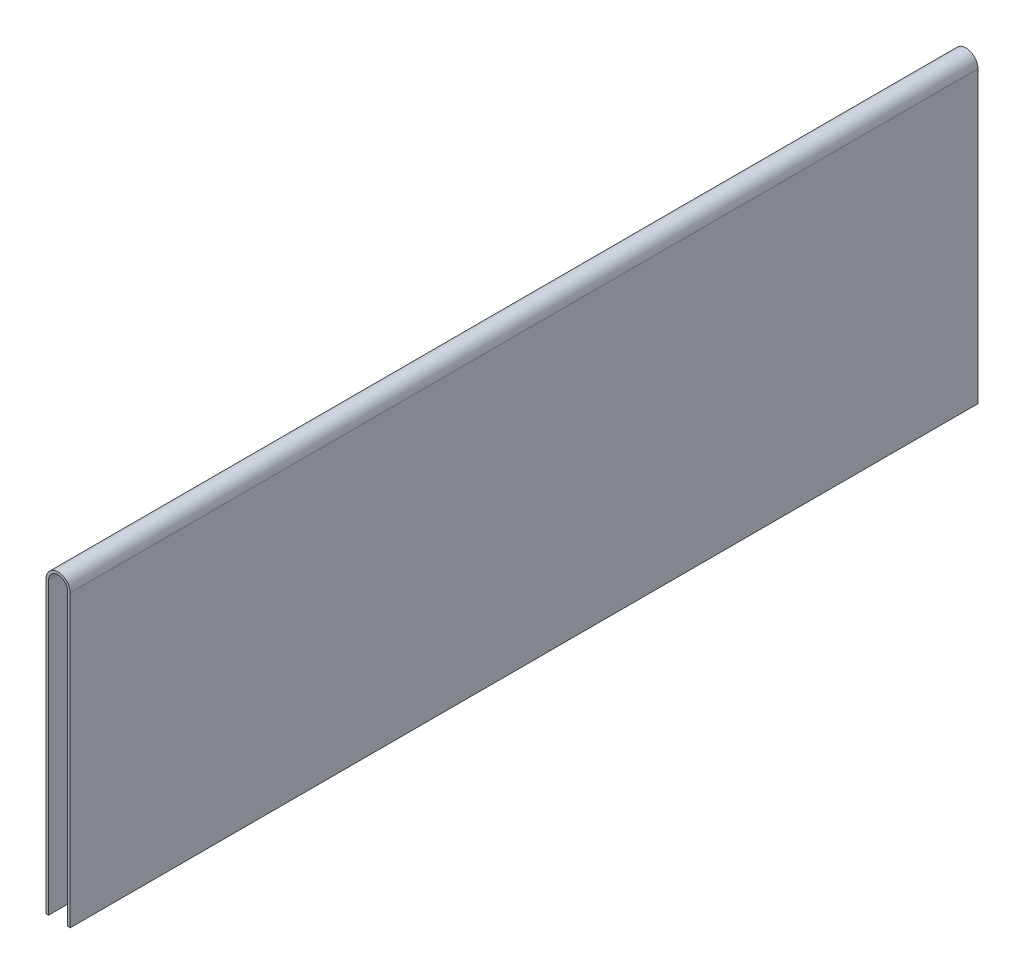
ISO-10303-21;
HEADER;
FILE_DESCRIPTION(('STEP AP214'),'2;1');
FILE_NAME('part.step','',(''),(''),'','','');
FILE_SCHEMA(('AUTOMOTIVE_DESIGN { 1 0 10303 214 1 1 1 1 }'));
ENDSEC;
DATA;
#1=APPLICATION_CONTEXT('core data for automotive mechanical design processes');
#2=APPLICATION_PROTOCOL_DEFINITION('international standard','automotive_design',2000,#1);
#3=PRODUCT_CONTEXT('',#1,'mechanical');
#4=PRODUCT('Part','Part','',(#3));
#5=PRODUCT_RELATED_PRODUCT_CATEGORY('part','',(#4));
#6=PRODUCT_DEFINITION_FORMATION('','',#4);
#7=PRODUCT_DEFINITION_CONTEXT('part definition',#1,'design');
#8=PRODUCT_DEFINITION('design','',#6,#7);
#9=PRODUCT_DEFINITION_SHAPE('','',#8);
#10=(LENGTH_UNIT() NAMED_UNIT(*) SI_UNIT(.MILLI.,.METRE.));
#11=(NAMED_UNIT(*) PLANE_ANGLE_UNIT() SI_UNIT($,.RADIAN.));
#12=(NAMED_UNIT(*) SI_UNIT($,.STERADIAN.) SOLID_ANGLE_UNIT());
#13=UNCERTAINTY_MEASURE_WITH_UNIT(LENGTH_MEASURE(1.E-05),#10,'distance_accuracy_value','');
#14=(GEOMETRIC_REPRESENTATION_CONTEXT(3) GLOBAL_UNCERTAINTY_ASSIGNED_CONTEXT((#13)) GLOBAL_UNIT_ASSIGNED_CONTEXT((#10,
#11,#12)) REPRESENTATION_CONTEXT('',''));
#15=CARTESIAN_POINT('',(0.,0.,0.));
#16=DIRECTION('',(0.,0.,1.));
#17=DIRECTION('',(1.,0.,0.));
#18=AXIS2_PLACEMENT_3D('',#15,#16,#17);
#19=CARTESIAN_POINT('',(-12.192,0.,914.4));
#20=DIRECTION('',(1.,0.,0.));
#21=DIRECTION('',(0.,1.,0.));
#22=AXIS2_PLACEMENT_3D('',#19,#20,#21);
#23=PLANE('',#22);
#24=DIRECTION('',(0.,-1.,0.));
#25=VECTOR('',#24,1.);
#26=CARTESIAN_POINT('',(-12.192,0.,0.));
#27=LINE('',#26,#25);
#28=CARTESIAN_POINT('',(-12.192,0.,0.));
#29=VERTEX_POINT('',#28);
#30=CARTESIAN_POINT('',(-12.192,-292.1,0.));
#31=VERTEX_POINT('',#30);
#32=EDGE_CURVE('E139',#29,#31,#27,.T.);
#33=ORIENTED_EDGE('',*,*,#32,.T.);
#34=DIRECTION('',(0.,0.,-1.));
#35=VECTOR('',#34,1.);
#36=CARTESIAN_POINT('',(-12.192,-292.1,914.4));
#37=LINE('',#36,#35);
#38=CARTESIAN_POINT('',(-12.192,-292.1,914.4));
#39=VERTEX_POINT('',#38);
#40=EDGE_CURVE('E13',#39,#31,#37,.T.);
#41=ORIENTED_EDGE('',*,*,#40,.F.);
#42=DIRECTION('',(0.,-1.,0.));
#43=VECTOR('',#42,1.);
#44=CARTESIAN_POINT('',(-12.192,0.,914.4));
#45=LINE('',#44,#43);
#46=CARTESIAN_POINT('',(-12.192,0.,914.4));
#47=VERTEX_POINT('',#46);
#48=EDGE_CURVE('E97',#47,#39,#45,.T.);
#49=ORIENTED_EDGE('',*,*,#48,.F.);
#50=DIRECTION('',(0.,0.,-1.));
#51=VECTOR('',#50,1.);
#52=CARTESIAN_POINT('',(-12.192,0.,914.4));
#53=LINE('',#52,#51);
#54=EDGE_CURVE('E138',#47,#29,#53,.T.);
#55=ORIENTED_EDGE('',*,*,#54,.T.);
#56=EDGE_LOOP('',(#33,#41,#49,#55));
#57=FACE_BOUND('',#56,.T.);
#58=ADVANCED_FACE('F42',(#57),#23,.F.);
#59=CARTESIAN_POINT('',(-9.65199999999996,-292.1,914.4));
#60=DIRECTION('',(0.,-1.,0.));
#61=DIRECTION('',(0.,0.,-1.));
#62=AXIS2_PLACEMENT_3D('',#59,#60,#61);
#63=PLANE('',#62);
#64=DIRECTION('',(-1.,0.,0.));
#65=VECTOR('',#64,1.);
#66=CARTESIAN_POINT('',(-9.65199999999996,-292.1,0.));
#67=LINE('',#66,#65);
#68=CARTESIAN_POINT('',(-9.65199999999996,-292.1,0.));
#69=VERTEX_POINT('',#68);
#70=EDGE_CURVE('E142',#69,#31,#67,.T.);
#71=ORIENTED_EDGE('',*,*,#70,.F.);
#72=DIRECTION('',(0.,0.,-1.));
#73=VECTOR('',#72,1.);
#74=CARTESIAN_POINT('',(-9.65199999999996,-292.1,914.4));
#75=LINE('',#74,#73);
#76=CARTESIAN_POINT('',(-9.65199999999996,-292.1,914.4));
#77=VERTEX_POINT('',#76);
#78=EDGE_CURVE('E50',#77,#69,#75,.T.);
#79=ORIENTED_EDGE('',*,*,#78,.F.);
#80=DIRECTION('',(-1.,0.,0.));
#81=VECTOR('',#80,1.);
#82=CARTESIAN_POINT('',(-9.65199999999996,-292.1,914.4));
#83=LINE('',#82,#81);
#84=EDGE_CURVE('E181',#77,#39,#83,.T.);
#85=ORIENTED_EDGE('',*,*,#84,.T.);
#86=ORIENTED_EDGE('',*,*,#40,.T.);
#87=EDGE_LOOP('',(#71,#79,#85,#86));
#88=FACE_BOUND('',#87,.T.);
#89=ADVANCED_FACE('F172',(#88),#63,.T.);
#90=CARTESIAN_POINT('',(-9.652,0.,914.4));
#91=DIRECTION('',(1.,0.,0.));
#92=DIRECTION('',(0.,1.,0.));
#93=AXIS2_PLACEMENT_3D('',#90,#91,#92);
#94=PLANE('',#93);
#95=DIRECTION('',(0.,-1.,0.));
#96=VECTOR('',#95,1.);
#97=CARTESIAN_POINT('',(-9.652,0.,0.));
#98=LINE('',#97,#96);
#99=CARTESIAN_POINT('',(-9.652,0.,0.));
#100=VERTEX_POINT('',#99);
#101=EDGE_CURVE('E145',#100,#69,#98,.T.);
#102=ORIENTED_EDGE('',*,*,#101,.F.);
#103=DIRECTION('',(0.,0.,-1.));
#104=VECTOR('',#103,1.);
#105=CARTESIAN_POINT('',(-9.652,0.,914.4));
#106=LINE('',#105,#104);
#107=CARTESIAN_POINT('',(-9.652,0.,914.4));
#108=VERTEX_POINT('',#107);
#109=EDGE_CURVE('E162',#108,#100,#106,.T.);
#110=ORIENTED_EDGE('',*,*,#109,.F.);
#111=DIRECTION('',(0.,-1.,0.));
#112=VECTOR('',#111,1.);
#113=CARTESIAN_POINT('',(-9.652,0.,914.4));
#114=LINE('',#113,#112);
#115=EDGE_CURVE('E169',#108,#77,#114,.T.);
#116=ORIENTED_EDGE('',*,*,#115,.T.);
#117=ORIENTED_EDGE('',*,*,#78,.T.);
#118=EDGE_LOOP('',(#102,#110,#116,#117));
#119=FACE_BOUND('',#118,.T.);
#120=ADVANCED_FACE('F167',(#119),#94,.T.);
#121=CARTESIAN_POINT('',(0.,0.,914.4));
#122=DIRECTION('',(0.,0.,-1.));
#123=DIRECTION('',(-1.,0.,0.));
#124=AXIS2_PLACEMENT_3D('',#121,#122,#123);
#125=CYLINDRICAL_SURFACE('',#124,9.652);
#126=CARTESIAN_POINT('',(0.,0.,0.));
#127=DIRECTION('',(0.,0.,1.));
#128=DIRECTION('',(1.,0.,0.));
#129=AXIS2_PLACEMENT_3D('',#126,#127,#128);
#130=CIRCLE('',#129,9.652);
#131=CARTESIAN_POINT('',(9.652,0.,0.));
#132=VERTEX_POINT('',#131);
#133=EDGE_CURVE('E148',#132,#100,#130,.T.);
#134=ORIENTED_EDGE('',*,*,#133,.F.);
#135=DIRECTION('',(0.,0.,-1.));
#136=VECTOR('',#135,1.);
#137=CARTESIAN_POINT('',(9.652,0.,914.4));
#138=LINE('',#137,#136);
#139=CARTESIAN_POINT('',(9.652,0.,914.4));
#140=VERTEX_POINT('',#139);
#141=EDGE_CURVE('E160',#140,#132,#138,.T.);
#142=ORIENTED_EDGE('',*,*,#141,.F.);
#143=CARTESIAN_POINT('',(0.,0.,914.4));
#144=DIRECTION('',(0.,0.,1.));
#145=DIRECTION('',(1.,0.,0.));
#146=AXIS2_PLACEMENT_3D('',#143,#144,#145);
#147=CIRCLE('',#146,9.652);
#148=EDGE_CURVE('E133',#140,#108,#147,.T.);
#149=ORIENTED_EDGE('',*,*,#148,.T.);
#150=ORIENTED_EDGE('',*,*,#109,.T.);
#151=EDGE_LOOP('',(#134,#142,#149,#150));
#152=FACE_BOUND('',#151,.T.);
#153=ADVANCED_FACE('F179',(#152),#125,.F.);
#154=CARTESIAN_POINT('',(9.652,0.,914.4));
#155=DIRECTION('',(-1.,0.,0.));
#156=DIRECTION('',(0.,-1.,0.));
#157=AXIS2_PLACEMENT_3D('',#154,#155,#156);
#158=PLANE('',#157);
#159=DIRECTION('',(0.,1.,0.));
#160=VECTOR('',#159,1.);
#161=CARTESIAN_POINT('',(9.652,0.,0.));
#162=LINE('',#161,#160);
#163=CARTESIAN_POINT('',(9.65200000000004,-292.1,0.));
#164=VERTEX_POINT('',#163);
#165=EDGE_CURVE('E151',#164,#132,#162,.T.);
#166=ORIENTED_EDGE('',*,*,#165,.F.);
#167=DIRECTION('',(0.,0.,-1.));
#168=VECTOR('',#167,1.);
#169=CARTESIAN_POINT('',(9.65200000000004,-292.1,914.4));
#170=LINE('',#169,#168);
#171=CARTESIAN_POINT('',(9.65200000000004,-292.1,914.4));
#172=VERTEX_POINT('',#171);
#173=EDGE_CURVE('E121',#172,#164,#170,.T.);
#174=ORIENTED_EDGE('',*,*,#173,.F.);
#175=DIRECTION('',(0.,1.,0.));
#176=VECTOR('',#175,1.);
#177=CARTESIAN_POINT('',(9.652,0.,914.4));
#178=LINE('',#177,#176);
#179=EDGE_CURVE('E131',#172,#140,#178,.T.);
#180=ORIENTED_EDGE('',*,*,#179,.T.);
#181=ORIENTED_EDGE('',*,*,#141,.T.);
#182=EDGE_LOOP('',(#166,#174,#180,#181));
#183=FACE_BOUND('',#182,.T.);
#184=ADVANCED_FACE('F186',(#183),#158,.T.);
#185=CARTESIAN_POINT('',(12.192,-292.1,914.4));
#186=DIRECTION('',(0.,-1.,0.));
#187=DIRECTION('',(0.,0.,-1.));
#188=AXIS2_PLACEMENT_3D('',#185,#186,#187);
#189=PLANE('',#188);
#190=DIRECTION('',(-1.,0.,0.));
#191=VECTOR('',#190,1.);
#192=CARTESIAN_POINT('',(12.192,-292.1,0.));
#193=LINE('',#192,#191);
#194=CARTESIAN_POINT('',(12.192,-292.1,0.));
#195=VERTEX_POINT('',#194);
#196=EDGE_CURVE('E120',#195,#164,#193,.T.);
#197=ORIENTED_EDGE('',*,*,#196,.F.);
#198=DIRECTION('',(0.,0.,-1.));
#199=VECTOR('',#198,1.);
#200=CARTESIAN_POINT('',(12.192,-292.1,914.4));
#201=LINE('',#200,#199);
#202=CARTESIAN_POINT('',(12.192,-292.1,914.4));
#203=VERTEX_POINT('',#202);
#204=EDGE_CURVE('E114',#203,#195,#201,.T.);
#205=ORIENTED_EDGE('',*,*,#204,.F.);
#206=DIRECTION('',(-1.,0.,0.));
#207=VECTOR('',#206,1.);
#208=CARTESIAN_POINT('',(12.192,-292.1,914.4));
#209=LINE('',#208,#207);
#210=EDGE_CURVE('E118',#203,#172,#209,.T.);
#211=ORIENTED_EDGE('',*,*,#210,.T.);
#212=ORIENTED_EDGE('',*,*,#173,.T.);
#213=EDGE_LOOP('',(#197,#205,#211,#212));
#214=FACE_BOUND('',#213,.T.);
#215=ADVANCED_FACE('F116',(#214),#189,.T.);
#216=CARTESIAN_POINT('',(12.192,0.,914.4));
#217=DIRECTION('',(-1.,0.,0.));
#218=DIRECTION('',(0.,-1.,0.));
#219=AXIS2_PLACEMENT_3D('',#216,#217,#218);
#220=PLANE('',#219);
#221=DIRECTION('',(0.,1.,0.));
#222=VECTOR('',#221,1.);
#223=CARTESIAN_POINT('',(12.192,0.,0.));
#224=LINE('',#223,#222);
#225=CARTESIAN_POINT('',(12.192,0.,0.));
#226=VERTEX_POINT('',#225);
#227=EDGE_CURVE('E85',#195,#226,#224,.T.);
#228=ORIENTED_EDGE('',*,*,#227,.T.);
#229=DIRECTION('',(0.,0.,-1.));
#230=VECTOR('',#229,1.);
#231=CARTESIAN_POINT('',(12.192,0.,914.4));
#232=LINE('',#231,#230);
#233=CARTESIAN_POINT('',(12.192,0.,914.4));
#234=VERTEX_POINT('',#233);
#235=EDGE_CURVE('E122',#234,#226,#232,.T.);
#236=ORIENTED_EDGE('',*,*,#235,.F.);
#237=DIRECTION('',(0.,1.,0.));
#238=VECTOR('',#237,1.);
#239=CARTESIAN_POINT('',(12.192,0.,914.4));
#240=LINE('',#239,#238);
#241=EDGE_CURVE('E124',#203,#234,#240,.T.);
#242=ORIENTED_EDGE('',*,*,#241,.F.);
#243=ORIENTED_EDGE('',*,*,#204,.T.);
#244=EDGE_LOOP('',(#228,#236,#242,#243));
#245=FACE_BOUND('',#244,.T.);
#246=ADVANCED_FACE('F125',(#245),#220,.F.);
#247=CARTESIAN_POINT('',(0.,0.,914.4));
#248=DIRECTION('',(0.,0.,-1.));
#249=DIRECTION('',(-1.,0.,0.));
#250=AXIS2_PLACEMENT_3D('',#247,#248,#249);
#251=CYLINDRICAL_SURFACE('',#250,12.192);
#252=CARTESIAN_POINT('',(0.,0.,0.));
#253=DIRECTION('',(0.,0.,1.));
#254=DIRECTION('',(1.,0.,0.));
#255=AXIS2_PLACEMENT_3D('',#252,#253,#254);
#256=CIRCLE('',#255,12.192);
#257=EDGE_CURVE('E91',#226,#29,#256,.T.);
#258=ORIENTED_EDGE('',*,*,#257,.T.);
#259=ORIENTED_EDGE('',*,*,#54,.F.);
#260=CARTESIAN_POINT('',(0.,0.,914.4));
#261=DIRECTION('',(0.,0.,1.));
#262=DIRECTION('',(1.,0.,0.));
#263=AXIS2_PLACEMENT_3D('',#260,#261,#262);
#264=CIRCLE('',#263,12.192);
#265=EDGE_CURVE('E58',#234,#47,#264,.T.);
#266=ORIENTED_EDGE('',*,*,#265,.F.);
#267=ORIENTED_EDGE('',*,*,#235,.T.);
#268=EDGE_LOOP('',(#258,#259,#266,#267));
#269=FACE_BOUND('',#268,.T.);
#270=ADVANCED_FACE('F188',(#269),#251,.T.);
#271=CARTESIAN_POINT('',(0.,0.,914.4));
#272=DIRECTION('',(0.,0.,1.));
#273=DIRECTION('',(1.,0.,0.));
#274=AXIS2_PLACEMENT_3D('',#271,#272,#273);
#275=PLANE('',#274);
#276=ORIENTED_EDGE('',*,*,#48,.T.);
#277=ORIENTED_EDGE('',*,*,#84,.F.);
#278=ORIENTED_EDGE('',*,*,#115,.F.);
#279=ORIENTED_EDGE('',*,*,#148,.F.);
#280=ORIENTED_EDGE('',*,*,#179,.F.);
#281=ORIENTED_EDGE('',*,*,#210,.F.);
#282=ORIENTED_EDGE('',*,*,#241,.T.);
#283=ORIENTED_EDGE('',*,*,#265,.T.);
#284=EDGE_LOOP('',(#276,#277,#278,#279,#280,#281,#282,#283));
#285=FACE_BOUND('',#284,.T.);
#286=ADVANCED_FACE('F128',(#285),#275,.T.);
#287=CARTESIAN_POINT('',(0.,0.,0.));
#288=DIRECTION('',(0.,0.,1.));
#289=DIRECTION('',(1.,0.,0.));
#290=AXIS2_PLACEMENT_3D('',#287,#288,#289);
#291=PLANE('',#290);
#292=ORIENTED_EDGE('',*,*,#32,.F.);
#293=ORIENTED_EDGE('',*,*,#257,.F.);
#294=ORIENTED_EDGE('',*,*,#227,.F.);
#295=ORIENTED_EDGE('',*,*,#196,.T.);
#296=ORIENTED_EDGE('',*,*,#165,.T.);
#297=ORIENTED_EDGE('',*,*,#133,.T.);
#298=ORIENTED_EDGE('',*,*,#101,.T.);
#299=ORIENTED_EDGE('',*,*,#70,.T.);
#300=EDGE_LOOP('',(#292,#293,#294,#295,#296,#297,#298,#299));
#301=FACE_BOUND('',#300,.T.);
#302=ADVANCED_FACE('F175',(#301),#291,.F.);
#303=CLOSED_SHELL('',(#58,#89,#120,#153,#184,#215,#246,#270,#286,#302));
#304=MANIFOLD_SOLID_BREP('B2',#303);
#305=ADVANCED_BREP_SHAPE_REPRESENTATION('',(#18,#304),#14);
#306=SHAPE_DEFINITION_REPRESENTATION(#9,#305);
ENDSEC;
END-ISO-10303-21;
